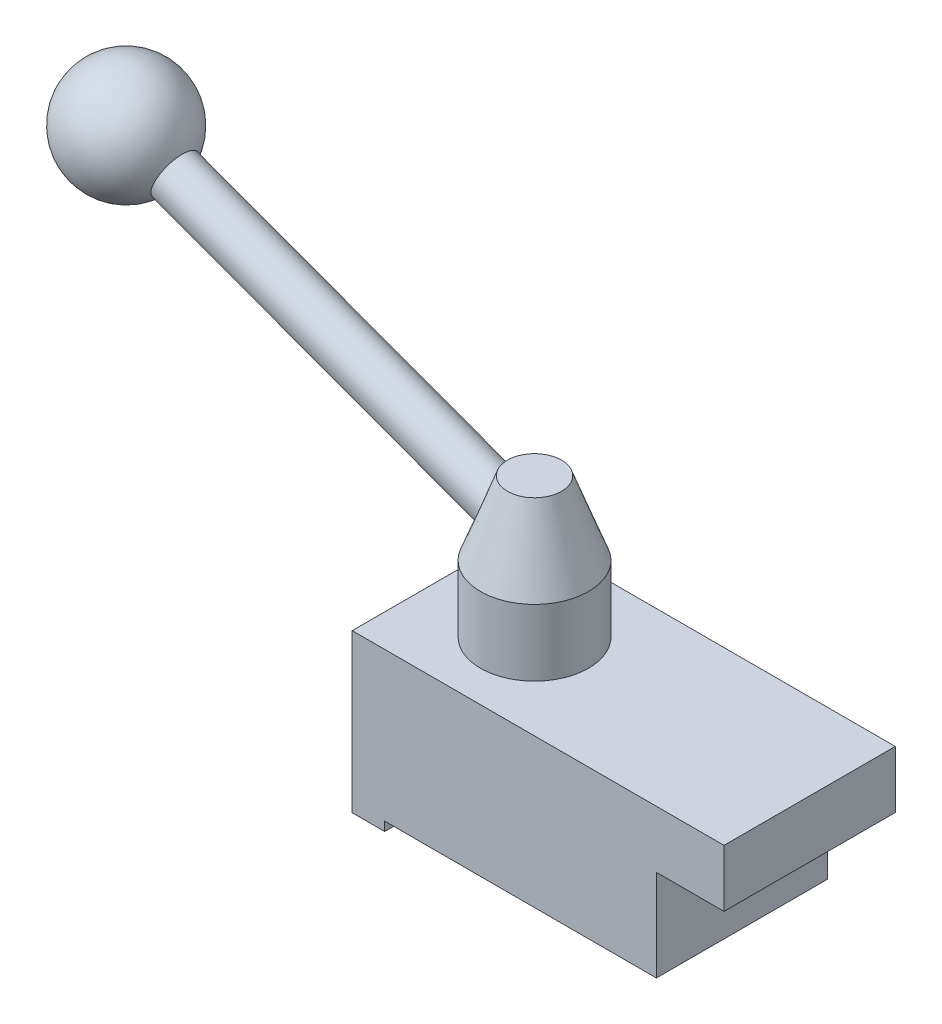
ISO-10303-21;
HEADER;
FILE_DESCRIPTION(('STEP AP214'),'2;1');
FILE_NAME('part.step','',(''),(''),'','','');
FILE_SCHEMA(('AUTOMOTIVE_DESIGN { 1 0 10303 214 1 1 1 1 }'));
ENDSEC;
DATA;
#1=APPLICATION_CONTEXT('core data for automotive mechanical design processes');
#2=APPLICATION_PROTOCOL_DEFINITION('international standard','automotive_design',2000,#1);
#3=PRODUCT_CONTEXT('',#1,'mechanical');
#4=PRODUCT('Part','Part','',(#3));
#5=PRODUCT_RELATED_PRODUCT_CATEGORY('part','',(#4));
#6=PRODUCT_DEFINITION_FORMATION('','',#4);
#7=PRODUCT_DEFINITION_CONTEXT('part definition',#1,'design');
#8=PRODUCT_DEFINITION('design','',#6,#7);
#9=PRODUCT_DEFINITION_SHAPE('','',#8);
#10=(LENGTH_UNIT() NAMED_UNIT(*) SI_UNIT(.MILLI.,.METRE.));
#11=(NAMED_UNIT(*) PLANE_ANGLE_UNIT() SI_UNIT($,.RADIAN.));
#12=(NAMED_UNIT(*) SI_UNIT($,.STERADIAN.) SOLID_ANGLE_UNIT());
#13=UNCERTAINTY_MEASURE_WITH_UNIT(LENGTH_MEASURE(1.E-05),#10,'distance_accuracy_value','');
#14=(GEOMETRIC_REPRESENTATION_CONTEXT(3) GLOBAL_UNCERTAINTY_ASSIGNED_CONTEXT((#13)) GLOBAL_UNIT_ASSIGNED_CONTEXT((#10,
#11,#12)) REPRESENTATION_CONTEXT('',''));
#15=CARTESIAN_POINT('',(0.,0.,0.));
#16=DIRECTION('',(0.,0.,1.));
#17=DIRECTION('',(1.,0.,0.));
#18=AXIS2_PLACEMENT_3D('',#15,#16,#17);
#19=CARTESIAN_POINT('',(-110.866216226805,56.3295401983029,0.));
#20=DIRECTION('',(0.938127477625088,-0.346290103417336,0.));
#21=DIRECTION('',(0.346290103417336,0.938127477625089,0.));
#22=AXIS2_PLACEMENT_3D('',#19,#20,#21);
#23=PLANE('',#22);
#24=CARTESIAN_POINT('',(-110.866216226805,56.3295401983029,0.));
#25=DIRECTION('',(0.938127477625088,-0.346290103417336,0.));
#26=DIRECTION('',(0.346290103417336,0.938127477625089,0.));
#27=AXIS2_PLACEMENT_3D('',#24,#25,#26);
#28=CIRCLE('',#27,4.99999999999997);
#29=CARTESIAN_POINT('',(-109.134765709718,61.0201775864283,0.));
#30=VERTEX_POINT('',#29);
#31=EDGE_CURVE('E11',#30,#30,#28,.T.);
#32=ORIENTED_EDGE('',*,*,#31,.T.);
#33=EDGE_LOOP('',(#32));
#34=FACE_BOUND('',#33,.T.);
#35=ADVANCED_FACE('F43',(#34),#23,.T.);
#36=CARTESIAN_POINT('',(-110.866216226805,56.3295401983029,0.));
#37=DIRECTION('',(0.938127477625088,-0.346290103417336,0.));
#38=DIRECTION('',(0.346290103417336,0.938127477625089,0.));
#39=AXIS2_PLACEMENT_3D('',#36,#37,#38);
#40=CYLINDRICAL_SURFACE('',#39,4.99999999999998);
#41=CARTESIAN_POINT('',(-185.916414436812,84.0327484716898,0.));
#42=DIRECTION('',(0.938127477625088,-0.346290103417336,0.));
#43=DIRECTION('',(0.346290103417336,0.938127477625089,0.));
#44=AXIS2_PLACEMENT_3D('',#41,#42,#43);
#45=CIRCLE('',#44,4.99999999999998);
#46=CARTESIAN_POINT('',(-184.184963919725,88.7233858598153,0.));
#47=VERTEX_POINT('',#46);
#48=EDGE_CURVE('E49',#47,#47,#45,.T.);
#49=CARTESIAN_POINT('',(-184.184963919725,88.7233858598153,0.));
#50=CARTESIAN_POINT('',(-183.403191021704,88.4348107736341,0.));
#51=CARTESIAN_POINT('',(-182.621418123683,88.146235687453,0.));
#52=CARTESIAN_POINT('',(-181.057872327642,87.5690855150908,0.));
#53=CARTESIAN_POINT('',(-180.276099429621,87.2805104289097,0.));
#54=CARTESIAN_POINT('',(-178.712553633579,86.7033602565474,0.));
#55=CARTESIAN_POINT('',(-177.930780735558,86.4147851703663,0.));
#56=CARTESIAN_POINT('',(-176.367234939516,85.8376349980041,0.));
#57=CARTESIAN_POINT('',(-175.585462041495,85.549059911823,0.));
#58=CARTESIAN_POINT('',(-174.021916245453,84.9719097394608,0.));
#59=CARTESIAN_POINT('',(-173.240143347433,84.6833346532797,0.));
#60=CARTESIAN_POINT('',(-171.676597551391,84.1061844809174,0.));
#61=CARTESIAN_POINT('',(-170.89482465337,83.8176093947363,0.));
#62=CARTESIAN_POINT('',(-169.331278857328,83.2404592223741,0.));
#63=CARTESIAN_POINT('',(-168.549505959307,82.951884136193,0.));
#64=CARTESIAN_POINT('',(-166.985960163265,82.3747339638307,0.));
#65=CARTESIAN_POINT('',(-166.204187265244,82.0861588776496,0.));
#66=CARTESIAN_POINT('',(-164.640641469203,81.5090087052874,0.));
#67=CARTESIAN_POINT('',(-163.858868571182,81.2204336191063,0.));
#68=CARTESIAN_POINT('',(-162.29532277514,80.6432834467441,0.));
#69=CARTESIAN_POINT('',(-161.513549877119,80.354708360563,0.));
#70=CARTESIAN_POINT('',(-159.950004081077,79.7775581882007,0.));
#71=CARTESIAN_POINT('',(-159.168231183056,79.4889831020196,0.));
#72=CARTESIAN_POINT('',(-157.604685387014,78.9118329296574,0.));
#73=CARTESIAN_POINT('',(-156.822912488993,78.6232578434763,0.));
#74=CARTESIAN_POINT('',(-155.259366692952,78.046107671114,0.));
#75=CARTESIAN_POINT('',(-154.477593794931,77.7575325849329,0.));
#76=CARTESIAN_POINT('',(-152.914047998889,77.1803824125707,0.));
#77=CARTESIAN_POINT('',(-152.132275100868,76.8918073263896,0.));
#78=CARTESIAN_POINT('',(-150.568729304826,76.3146571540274,0.));
#79=CARTESIAN_POINT('',(-149.786956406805,76.0260820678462,0.));
#80=CARTESIAN_POINT('',(-148.223410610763,75.448931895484,0.));
#81=CARTESIAN_POINT('',(-147.441637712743,75.1603568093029,0.));
#82=CARTESIAN_POINT('',(-145.878091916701,74.5832066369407,0.));
#83=CARTESIAN_POINT('',(-145.09631901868,74.2946315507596,0.));
#84=CARTESIAN_POINT('',(-143.532773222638,73.7174813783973,0.));
#85=CARTESIAN_POINT('',(-142.751000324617,73.4289062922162,0.));
#86=CARTESIAN_POINT('',(-141.187454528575,72.851756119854,0.));
#87=CARTESIAN_POINT('',(-140.405681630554,72.5631810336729,0.));
#88=CARTESIAN_POINT('',(-138.842135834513,71.9860308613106,0.));
#89=CARTESIAN_POINT('',(-138.060362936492,71.6974557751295,0.));
#90=CARTESIAN_POINT('',(-136.49681714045,71.1203056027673,0.));
#91=CARTESIAN_POINT('',(-135.715044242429,70.8317305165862,0.));
#92=CARTESIAN_POINT('',(-134.151498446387,70.254580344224,0.));
#93=CARTESIAN_POINT('',(-133.369725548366,69.9660052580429,0.));
#94=CARTESIAN_POINT('',(-131.806179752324,69.3888550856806,0.));
#95=CARTESIAN_POINT('',(-131.024406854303,69.1002799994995,0.));
#96=CARTESIAN_POINT('',(-129.460861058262,68.5231298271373,0.));
#97=CARTESIAN_POINT('',(-128.679088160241,68.2345547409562,0.));
#98=CARTESIAN_POINT('',(-127.115542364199,67.6574045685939,0.));
#99=CARTESIAN_POINT('',(-126.333769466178,67.3688294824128,0.));
#100=CARTESIAN_POINT('',(-124.770223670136,66.7916793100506,0.));
#101=CARTESIAN_POINT('',(-123.988450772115,66.5031042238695,0.));
#102=CARTESIAN_POINT('',(-122.424904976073,65.9259540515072,0.));
#103=CARTESIAN_POINT('',(-121.643132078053,65.6373789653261,0.));
#104=CARTESIAN_POINT('',(-120.079586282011,65.0602287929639,0.));
#105=CARTESIAN_POINT('',(-119.29781338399,64.7716537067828,0.));
#106=CARTESIAN_POINT('',(-117.734267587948,64.1945035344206,0.));
#107=CARTESIAN_POINT('',(-116.952494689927,63.9059284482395,0.));
#108=CARTESIAN_POINT('',(-115.388948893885,63.3287782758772,0.));
#109=CARTESIAN_POINT('',(-114.607175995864,63.0402031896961,0.));
#110=CARTESIAN_POINT('',(-113.043630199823,62.4630530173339,0.));
#111=CARTESIAN_POINT('',(-112.261857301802,62.1744779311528,0.));
#112=CARTESIAN_POINT('',(-110.69831150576,61.5973277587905,0.));
#113=CARTESIAN_POINT('',(-109.916538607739,61.3087526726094,0.));
#114=CARTESIAN_POINT('',(-109.134765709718,61.0201775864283,0.));
#115=B_SPLINE_CURVE_WITH_KNOTS('',3,(#49,#50,#51,#52,#53,#54,#55,#56,#57,#58,#59,#60,#61,#62,
#63,#64,#65,#66,#67,#68,#69,#70,#71,#72,#73,#74,#75,#76,#77,#78,#79,#80,#81,#82,#83,#84,#85,#86,
#87,#88,#89,#90,#91,#92,#93,#94,#95,#96,#97,#98,#99,#100,#101,#102,#103,#104,#105,#106,#107,
#108,#109,#110,#111,#112,#113,#114),.UNSPECIFIED.,.F.,.F.,(4,2,2,2,2,2,2,2,2,2,2,2,2,2,2,2,2,2,
2,2,2,2,2,2,2,2,2,2,2,2,2,2,4),(0.,2.49999999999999,5.00000000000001,7.50000000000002,10.,12.5,
15.,17.5,20.,22.5000000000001,25.,27.5000000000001,30.,32.5000000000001,35.0000000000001,
37.5000000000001,40.0000000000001,42.5000000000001,45.0000000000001,47.5000000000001,
50.0000000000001,52.5000000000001,55.0000000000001,57.5000000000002,60.0000000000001,
62.5000000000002,65.0000000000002,67.5000000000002,70.0000000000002,72.5000000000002,
75.0000000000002,77.5000000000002,80.0000000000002),.UNSPECIFIED.);
#116=EDGE_CURVE('BSEAM55',#47,#30,#115,.T.);
#117=ORIENTED_EDGE('',*,*,#48,.T.);
#118=ORIENTED_EDGE('',*,*,#31,.F.);
#119=ORIENTED_EDGE('',*,*,#116,.T.);
#120=ORIENTED_EDGE('',*,*,#116,.F.);
#121=EDGE_LOOP('',(#117,#119,#118,#120));
#122=FACE_BOUND('',#121,.T.);
#123=ADVANCED_FACE('F55',(#122),#40,.T.);
#124=CARTESIAN_POINT('',(-196.664014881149,87.9999999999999,0.));
#125=DIRECTION('',(0.938127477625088,-0.346290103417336,0.));
#126=DIRECTION('',(0.346290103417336,0.938127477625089,0.));
#127=AXIS2_PLACEMENT_3D('',#124,#125,#126);
#128=SPHERICAL_SURFACE('',#127,12.5);
#129=ORIENTED_EDGE('',*,*,#48,.F.);
#130=EDGE_LOOP('',(#129));
#131=FACE_BOUND('',#130,.T.);
#132=ADVANCED_FACE('F58',(#131),#128,.T.);
#133=CLOSED_SHELL('',(#35,#123,#132));
#134=MANIFOLD_SOLID_BREP('B2',#133);
#135=CARTESIAN_POINT('',(-106.046924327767,35.,0.));
#136=DIRECTION('',(0.,1.,0.));
#137=DIRECTION('',(0.,0.,1.));
#138=AXIS2_PLACEMENT_3D('',#135,#136,#137);
#139=PLANE('',#138);
#140=CARTESIAN_POINT('',(-106.046924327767,35.,0.));
#141=DIRECTION('',(0.,-1.,0.));
#142=DIRECTION('',(0.,0.,-1.));
#143=AXIS2_PLACEMENT_3D('',#140,#141,#142);
#144=CIRCLE('',#143,12.);
#145=CARTESIAN_POINT('',(-106.046924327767,35.,-12.));
#146=VERTEX_POINT('',#145);
#147=EDGE_CURVE('E42',#146,#146,#144,.T.);
#148=ORIENTED_EDGE('',*,*,#147,.T.);
#149=EDGE_LOOP('',(#148));
#150=FACE_BOUND('',#149,.T.);
#151=ADVANCED_FACE('F86',(#150),#139,.F.);
#152=CARTESIAN_POINT('',(-106.046924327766,-18.162504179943,0.));
#153=DIRECTION('',(0.,-1.,0.));
#154=DIRECTION('',(0.,0.,-1.));
#155=AXIS2_PLACEMENT_3D('',#152,#153,#154);
#156=CYLINDRICAL_SURFACE('',#155,12.);
#157=ORIENTED_EDGE('',*,*,#147,.F.);
#158=EDGE_LOOP('',(#157));
#159=FACE_BOUND('',#158,.T.);
#160=CARTESIAN_POINT('',(-106.046924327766,49.7455220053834,0.));
#161=DIRECTION('',(0.,-1.,0.));
#162=DIRECTION('',(0.,0.,-1.));
#163=AXIS2_PLACEMENT_3D('',#160,#161,#162);
#164=CIRCLE('',#163,12.);
#165=CARTESIAN_POINT('',(-106.046924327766,49.7455220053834,-11.9999999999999));
#166=VERTEX_POINT('',#165);
#167=EDGE_CURVE('E92',#166,#166,#164,.T.);
#168=ORIENTED_EDGE('',*,*,#167,.T.);
#169=EDGE_LOOP('',(#168));
#170=FACE_BOUND('',#169,.T.);
#171=ADVANCED_FACE('F111',(#159,#170),#156,.T.);
#172=CARTESIAN_POINT('',(-106.046924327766,65.9999999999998,0.));
#173=DIRECTION('',(0.,-1.,0.));
#174=DIRECTION('',(0.,0.,-1.));
#175=AXIS2_PLACEMENT_3D('',#172,#173,#174);
#176=CONICAL_SURFACE('',#175,6.00000000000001,0.353613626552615);
#177=ORIENTED_EDGE('',*,*,#167,.F.);
#178=EDGE_LOOP('',(#177));
#179=FACE_BOUND('',#178,.T.);
#180=CARTESIAN_POINT('',(-106.046924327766,65.9999999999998,0.));
#181=DIRECTION('',(0.,-1.,0.));
#182=DIRECTION('',(0.,0.,-1.));
#183=AXIS2_PLACEMENT_3D('',#180,#181,#182);
#184=CIRCLE('',#183,6.00000000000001);
#185=CARTESIAN_POINT('',(-106.046924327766,65.9999999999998,-6.));
#186=VERTEX_POINT('',#185);
#187=EDGE_CURVE('E96',#186,#186,#184,.T.);
#188=ORIENTED_EDGE('',*,*,#187,.T.);
#189=EDGE_LOOP('',(#188));
#190=FACE_BOUND('',#189,.T.);
#191=ADVANCED_FACE('F103',(#179,#190),#176,.T.);
#192=CARTESIAN_POINT('',(-112.046924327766,66.,0.));
#193=DIRECTION('',(0.,-1.,0.));
#194=DIRECTION('',(0.,0.,-1.));
#195=AXIS2_PLACEMENT_3D('',#192,#193,#194);
#196=PLANE('',#195);
#197=ORIENTED_EDGE('',*,*,#187,.F.);
#198=EDGE_LOOP('',(#197));
#199=FACE_BOUND('',#198,.T.);
#200=ADVANCED_FACE('F105',(#199),#196,.F.);
#201=CLOSED_SHELL('',(#151,#171,#191,#200));
#202=MANIFOLD_SOLID_BREP('B6',#201);
#203=CARTESIAN_POINT('',(-127.5,34.9999999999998,19.0000000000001));
#204=DIRECTION('',(1.,0.,0.));
#205=DIRECTION('',(0.,0.,-1.));
#206=AXIS2_PLACEMENT_3D('',#203,#204,#205);
#207=PLANE('',#206);
#208=DIRECTION('',(0.,-1.,0.));
#209=VECTOR('',#208,1.);
#210=CARTESIAN_POINT('',(-127.5,34.9999999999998,-19.));
#211=LINE('',#210,#209);
#212=CARTESIAN_POINT('',(-127.5,34.9999999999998,-19.));
#213=VERTEX_POINT('',#212);
#214=CARTESIAN_POINT('',(-127.5,-4.44089209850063E-13,-19.));
#215=VERTEX_POINT('',#214);
#216=EDGE_CURVE('E229',#213,#215,#211,.T.);
#217=ORIENTED_EDGE('',*,*,#216,.T.);
#218=DIRECTION('',(0.,0.,-1.));
#219=VECTOR('',#218,1.);
#220=CARTESIAN_POINT('',(-127.5,0.,19.));
#221=LINE('',#220,#219);
#222=CARTESIAN_POINT('',(-127.5,0.,19.));
#223=VERTEX_POINT('',#222);
#224=EDGE_CURVE('E84',#223,#215,#221,.T.);
#225=ORIENTED_EDGE('',*,*,#224,.F.);
#226=DIRECTION('',(0.,-1.,0.));
#227=VECTOR('',#226,1.);
#228=CARTESIAN_POINT('',(-127.5,34.9999999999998,19.0000000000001));
#229=LINE('',#228,#227);
#230=CARTESIAN_POINT('',(-127.5,34.9999999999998,19.0000000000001));
#231=VERTEX_POINT('',#230);
#232=EDGE_CURVE('E243',#231,#223,#229,.T.);
#233=ORIENTED_EDGE('',*,*,#232,.F.);
#234=DIRECTION('',(0.,0.,-1.));
#235=VECTOR('',#234,1.);
#236=CARTESIAN_POINT('',(-127.5,34.9999999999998,19.0000000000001));
#237=LINE('',#236,#235);
#238=EDGE_CURVE('E225',#231,#213,#237,.T.);
#239=ORIENTED_EDGE('',*,*,#238,.T.);
#240=EDGE_LOOP('',(#217,#225,#233,#239));
#241=FACE_BOUND('',#240,.T.);
#242=ADVANCED_FACE('F133',(#241),#207,.F.);
#243=CARTESIAN_POINT('',(-127.5,0.,19.));
#244=DIRECTION('',(0.,1.,0.));
#245=DIRECTION('',(0.,0.,1.));
#246=AXIS2_PLACEMENT_3D('',#243,#244,#245);
#247=PLANE('',#246);
#248=DIRECTION('',(1.,0.,0.));
#249=VECTOR('',#248,1.);
#250=CARTESIAN_POINT('',(-127.5,-4.44089209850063E-13,-19.));
#251=LINE('',#250,#249);
#252=CARTESIAN_POINT('',(-120.290628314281,-4.44089209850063E-13,-19.0000000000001));
#253=VERTEX_POINT('',#252);
#254=EDGE_CURVE('E232',#215,#253,#251,.T.);
#255=ORIENTED_EDGE('',*,*,#254,.T.);
#256=DIRECTION('',(0.,0.,-1.));
#257=VECTOR('',#256,1.);
#258=CARTESIAN_POINT('',(-120.290628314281,-2.77555756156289E-13,19.));
#259=LINE('',#258,#257);
#260=CARTESIAN_POINT('',(-120.290628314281,-2.77555756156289E-13,19.));
#261=VERTEX_POINT('',#260);
#262=EDGE_CURVE('E141',#261,#253,#259,.T.);
#263=ORIENTED_EDGE('',*,*,#262,.F.);
#264=DIRECTION('',(1.,0.,0.));
#265=VECTOR('',#264,1.);
#266=CARTESIAN_POINT('',(-127.5,0.,19.));
#267=LINE('',#266,#265);
#268=EDGE_CURVE('E192',#223,#261,#267,.T.);
#269=ORIENTED_EDGE('',*,*,#268,.F.);
#270=ORIENTED_EDGE('',*,*,#224,.T.);
#271=EDGE_LOOP('',(#255,#263,#269,#270));
#272=FACE_BOUND('',#271,.T.);
#273=ADVANCED_FACE('F278',(#272),#247,.F.);
#274=CARTESIAN_POINT('',(-120.290628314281,-2.77555756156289E-13,19.));
#275=DIRECTION('',(-1.,0.,0.));
#276=DIRECTION('',(0.,0.,1.));
#277=AXIS2_PLACEMENT_3D('',#274,#275,#276);
#278=PLANE('',#277);
#279=DIRECTION('',(0.,1.,0.));
#280=VECTOR('',#279,1.);
#281=CARTESIAN_POINT('',(-120.290628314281,-4.44089209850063E-13,-19.0000000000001));
#282=LINE('',#281,#280);
#283=CARTESIAN_POINT('',(-120.290628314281,1.99999999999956,-19.0000000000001));
#284=VERTEX_POINT('',#283);
#285=EDGE_CURVE('E234',#253,#284,#282,.T.);
#286=ORIENTED_EDGE('',*,*,#285,.T.);
#287=DIRECTION('',(0.,0.,-1.));
#288=VECTOR('',#287,1.);
#289=CARTESIAN_POINT('',(-120.290628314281,1.99999999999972,19.));
#290=LINE('',#289,#288);
#291=CARTESIAN_POINT('',(-120.290628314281,1.99999999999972,19.));
#292=VERTEX_POINT('',#291);
#293=EDGE_CURVE('E250',#292,#284,#290,.T.);
#294=ORIENTED_EDGE('',*,*,#293,.F.);
#295=DIRECTION('',(0.,1.,0.));
#296=VECTOR('',#295,1.);
#297=CARTESIAN_POINT('',(-120.290628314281,-2.77555756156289E-13,19.));
#298=LINE('',#297,#296);
#299=EDGE_CURVE('E258',#261,#292,#298,.T.);
#300=ORIENTED_EDGE('',*,*,#299,.F.);
#301=ORIENTED_EDGE('',*,*,#262,.T.);
#302=EDGE_LOOP('',(#286,#294,#300,#301));
#303=FACE_BOUND('',#302,.T.);
#304=ADVANCED_FACE('F256',(#303),#278,.F.);
#305=CARTESIAN_POINT('',(-120.290628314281,1.99999999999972,19.));
#306=DIRECTION('',(0.,1.,0.));
#307=DIRECTION('',(0.,0.,1.));
#308=AXIS2_PLACEMENT_3D('',#305,#306,#307);
#309=PLANE('',#308);
#310=DIRECTION('',(1.,0.,0.));
#311=VECTOR('',#310,1.);
#312=CARTESIAN_POINT('',(-120.290628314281,1.99999999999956,-19.0000000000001));
#313=LINE('',#312,#311);
#314=CARTESIAN_POINT('',(-60.,2.00000000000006,-19.0000000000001));
#315=VERTEX_POINT('',#314);
#316=EDGE_CURVE('E236',#284,#315,#313,.T.);
#317=ORIENTED_EDGE('',*,*,#316,.T.);
#318=DIRECTION('',(0.,0.,-1.));
#319=VECTOR('',#318,1.);
#320=CARTESIAN_POINT('',(-60.0000000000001,1.99999999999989,19.));
#321=LINE('',#320,#319);
#322=CARTESIAN_POINT('',(-60.0000000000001,1.99999999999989,19.));
#323=VERTEX_POINT('',#322);
#324=EDGE_CURVE('E247',#323,#315,#321,.T.);
#325=ORIENTED_EDGE('',*,*,#324,.F.);
#326=DIRECTION('',(1.,0.,0.));
#327=VECTOR('',#326,1.);
#328=CARTESIAN_POINT('',(-120.290628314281,1.99999999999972,19.));
#329=LINE('',#328,#327);
#330=EDGE_CURVE('E270',#292,#323,#329,.T.);
#331=ORIENTED_EDGE('',*,*,#330,.F.);
#332=ORIENTED_EDGE('',*,*,#293,.T.);
#333=EDGE_LOOP('',(#317,#325,#331,#332));
#334=FACE_BOUND('',#333,.T.);
#335=ADVANCED_FACE('F266',(#334),#309,.F.);
#336=CARTESIAN_POINT('',(-60.0000000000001,1.99999999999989,19.));
#337=DIRECTION('',(-1.,0.,0.));
#338=DIRECTION('',(0.,0.,1.));
#339=AXIS2_PLACEMENT_3D('',#336,#337,#338);
#340=PLANE('',#339);
#341=DIRECTION('',(0.,1.,0.));
#342=VECTOR('',#341,1.);
#343=CARTESIAN_POINT('',(-60.,2.00000000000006,-19.0000000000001));
#344=LINE('',#343,#342);
#345=CARTESIAN_POINT('',(-60.,22.3,-19.));
#346=VERTEX_POINT('',#345);
#347=EDGE_CURVE('E238',#315,#346,#344,.T.);
#348=ORIENTED_EDGE('',*,*,#347,.T.);
#349=DIRECTION('',(0.,0.,-1.));
#350=VECTOR('',#349,1.);
#351=CARTESIAN_POINT('',(-60.0000000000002,22.2999999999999,19.0000000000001));
#352=LINE('',#351,#350);
#353=CARTESIAN_POINT('',(-60.0000000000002,22.2999999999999,19.0000000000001));
#354=VERTEX_POINT('',#353);
#355=EDGE_CURVE('E220',#354,#346,#352,.T.);
#356=ORIENTED_EDGE('',*,*,#355,.F.);
#357=DIRECTION('',(0.,1.,0.));
#358=VECTOR('',#357,1.);
#359=CARTESIAN_POINT('',(-60.0000000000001,1.99999999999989,19.));
#360=LINE('',#359,#358);
#361=EDGE_CURVE('E211',#323,#354,#360,.T.);
#362=ORIENTED_EDGE('',*,*,#361,.F.);
#363=ORIENTED_EDGE('',*,*,#324,.T.);
#364=EDGE_LOOP('',(#348,#356,#362,#363));
#365=FACE_BOUND('',#364,.T.);
#366=ADVANCED_FACE('F269',(#365),#340,.F.);
#367=CARTESIAN_POINT('',(-60.0000000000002,22.2999999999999,19.0000000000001));
#368=DIRECTION('',(0.,1.,0.));
#369=DIRECTION('',(-1.,0.,0.));
#370=AXIS2_PLACEMENT_3D('',#367,#368,#369);
#371=PLANE('',#370);
#372=DIRECTION('',(1.,0.,0.));
#373=VECTOR('',#372,1.);
#374=CARTESIAN_POINT('',(-60.,22.3,-19.));
#375=LINE('',#374,#373);
#376=CARTESIAN_POINT('',(-45.0000000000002,22.2999999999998,-19.0000000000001));
#377=VERTEX_POINT('',#376);
#378=EDGE_CURVE('E219',#346,#377,#375,.T.);
#379=ORIENTED_EDGE('',*,*,#378,.T.);
#380=DIRECTION('',(0.,0.,-1.));
#381=VECTOR('',#380,1.);
#382=CARTESIAN_POINT('',(-45.0000000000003,22.2999999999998,19.0000000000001));
#383=LINE('',#382,#381);
#384=CARTESIAN_POINT('',(-45.0000000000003,22.2999999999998,19.0000000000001));
#385=VERTEX_POINT('',#384);
#386=EDGE_CURVE('E216',#385,#377,#383,.T.);
#387=ORIENTED_EDGE('',*,*,#386,.F.);
#388=DIRECTION('',(1.,0.,0.));
#389=VECTOR('',#388,1.);
#390=CARTESIAN_POINT('',(-60.0000000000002,22.2999999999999,19.0000000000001));
#391=LINE('',#390,#389);
#392=EDGE_CURVE('E205',#354,#385,#391,.T.);
#393=ORIENTED_EDGE('',*,*,#392,.F.);
#394=ORIENTED_EDGE('',*,*,#355,.T.);
#395=EDGE_LOOP('',(#379,#387,#393,#394));
#396=FACE_BOUND('',#395,.T.);
#397=ADVANCED_FACE('F217',(#396),#371,.F.);
#398=CARTESIAN_POINT('',(-45.0000000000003,22.2999999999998,19.0000000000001));
#399=DIRECTION('',(-1.,0.,0.));
#400=DIRECTION('',(0.,0.,1.));
#401=AXIS2_PLACEMENT_3D('',#398,#399,#400);
#402=PLANE('',#401);
#403=DIRECTION('',(0.,1.,0.));
#404=VECTOR('',#403,1.);
#405=CARTESIAN_POINT('',(-45.0000000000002,22.2999999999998,-19.0000000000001));
#406=LINE('',#405,#404);
#407=CARTESIAN_POINT('',(-45.,34.9999999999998,-19.0000000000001));
#408=VERTEX_POINT('',#407);
#409=EDGE_CURVE('E178',#377,#408,#406,.T.);
#410=ORIENTED_EDGE('',*,*,#409,.T.);
#411=DIRECTION('',(0.,0.,-1.));
#412=VECTOR('',#411,1.);
#413=CARTESIAN_POINT('',(-45.0000000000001,34.9999999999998,19.));
#414=LINE('',#413,#412);
#415=CARTESIAN_POINT('',(-45.0000000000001,34.9999999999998,19.));
#416=VERTEX_POINT('',#415);
#417=EDGE_CURVE('E221',#416,#408,#414,.T.);
#418=ORIENTED_EDGE('',*,*,#417,.F.);
#419=DIRECTION('',(0.,1.,0.));
#420=VECTOR('',#419,1.);
#421=CARTESIAN_POINT('',(-45.0000000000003,22.2999999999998,19.0000000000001));
#422=LINE('',#421,#420);
#423=EDGE_CURVE('E209',#385,#416,#422,.T.);
#424=ORIENTED_EDGE('',*,*,#423,.F.);
#425=ORIENTED_EDGE('',*,*,#386,.T.);
#426=EDGE_LOOP('',(#410,#418,#424,#425));
#427=FACE_BOUND('',#426,.T.);
#428=ADVANCED_FACE('F223',(#427),#402,.F.);
#429=CARTESIAN_POINT('',(-45.0000000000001,34.9999999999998,19.));
#430=DIRECTION('',(0.,-1.,0.));
#431=DIRECTION('',(1.,0.,0.));
#432=AXIS2_PLACEMENT_3D('',#429,#430,#431);
#433=PLANE('',#432);
#434=DIRECTION('',(-1.,0.,0.));
#435=VECTOR('',#434,1.);
#436=CARTESIAN_POINT('',(-45.,34.9999999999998,-19.0000000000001));
#437=LINE('',#436,#435);
#438=EDGE_CURVE('E184',#408,#213,#437,.T.);
#439=ORIENTED_EDGE('',*,*,#438,.T.);
#440=ORIENTED_EDGE('',*,*,#238,.F.);
#441=DIRECTION('',(-1.,0.,0.));
#442=VECTOR('',#441,1.);
#443=CARTESIAN_POINT('',(-45.0000000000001,34.9999999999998,19.));
#444=LINE('',#443,#442);
#445=EDGE_CURVE('E149',#416,#231,#444,.T.);
#446=ORIENTED_EDGE('',*,*,#445,.F.);
#447=ORIENTED_EDGE('',*,*,#417,.T.);
#448=EDGE_LOOP('',(#439,#440,#446,#447));
#449=FACE_BOUND('',#448,.T.);
#450=ADVANCED_FACE('F294',(#449),#433,.F.);
#451=CARTESIAN_POINT('',(-127.5,0.,19.));
#452=DIRECTION('',(0.,0.,1.));
#453=DIRECTION('',(1.,0.,0.));
#454=AXIS2_PLACEMENT_3D('',#451,#452,#453);
#455=PLANE('',#454);
#456=ORIENTED_EDGE('',*,*,#232,.T.);
#457=ORIENTED_EDGE('',*,*,#268,.T.);
#458=ORIENTED_EDGE('',*,*,#299,.T.);
#459=ORIENTED_EDGE('',*,*,#330,.T.);
#460=ORIENTED_EDGE('',*,*,#361,.T.);
#461=ORIENTED_EDGE('',*,*,#392,.T.);
#462=ORIENTED_EDGE('',*,*,#423,.T.);
#463=ORIENTED_EDGE('',*,*,#445,.T.);
#464=EDGE_LOOP('',(#456,#457,#458,#459,#460,#461,#462,#463));
#465=FACE_BOUND('',#464,.T.);
#466=ADVANCED_FACE('F207',(#465),#455,.T.);
#467=CARTESIAN_POINT('',(-127.5,-4.44089209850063E-13,-19.));
#468=DIRECTION('',(0.,0.,1.));
#469=DIRECTION('',(1.,0.,0.));
#470=AXIS2_PLACEMENT_3D('',#467,#468,#469);
#471=PLANE('',#470);
#472=ORIENTED_EDGE('',*,*,#216,.F.);
#473=ORIENTED_EDGE('',*,*,#438,.F.);
#474=ORIENTED_EDGE('',*,*,#409,.F.);
#475=ORIENTED_EDGE('',*,*,#378,.F.);
#476=ORIENTED_EDGE('',*,*,#347,.F.);
#477=ORIENTED_EDGE('',*,*,#316,.F.);
#478=ORIENTED_EDGE('',*,*,#285,.F.);
#479=ORIENTED_EDGE('',*,*,#254,.F.);
#480=EDGE_LOOP('',(#472,#473,#474,#475,#476,#477,#478,#479));
#481=FACE_BOUND('',#480,.T.);
#482=ADVANCED_FACE('F262',(#481),#471,.F.);
#483=CLOSED_SHELL('',(#242,#273,#304,#335,#366,#397,#428,#450,#466,#482));
#484=MANIFOLD_SOLID_BREP('B37',#483);
#485=ADVANCED_BREP_SHAPE_REPRESENTATION('',(#18,#134,#202,#484),#14);
#486=SHAPE_DEFINITION_REPRESENTATION(#9,#485);
ENDSEC;
END-ISO-10303-21;
